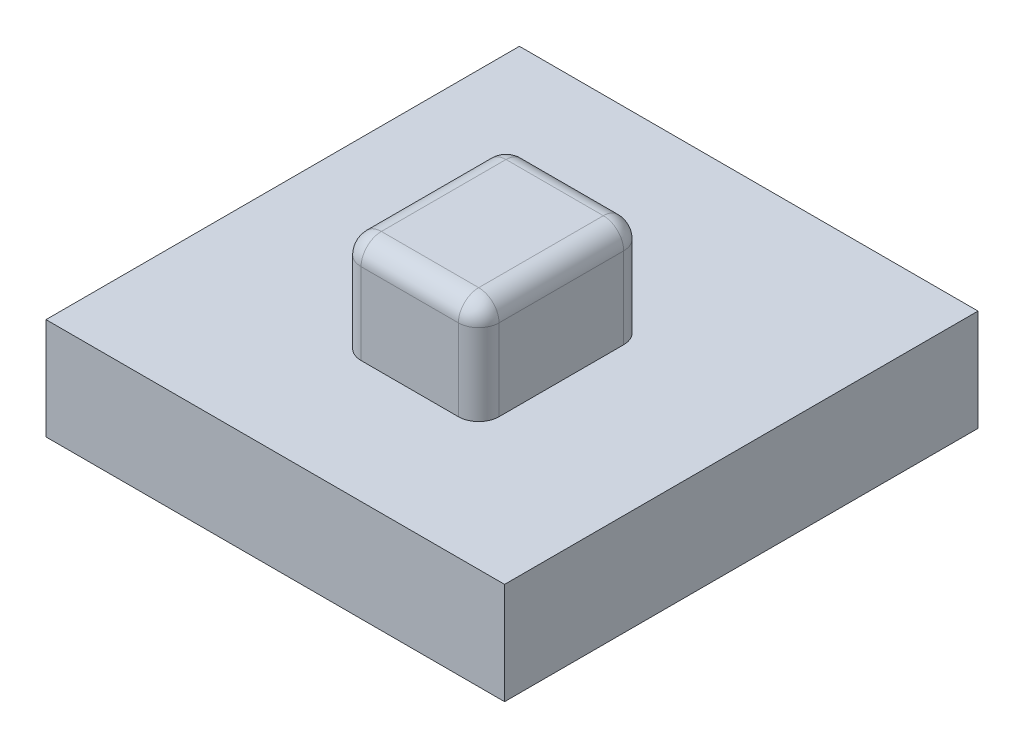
ISO-10303-21;
HEADER;
FILE_DESCRIPTION(('STEP AP214'),'2;1');
FILE_NAME('part.step','',(''),(''),'','','');
FILE_SCHEMA(('AUTOMOTIVE_DESIGN { 1 0 10303 214 1 1 1 1 }'));
ENDSEC;
DATA;
#1=APPLICATION_CONTEXT('core data for automotive mechanical design processes');
#2=APPLICATION_PROTOCOL_DEFINITION('international standard','automotive_design',2000,#1);
#3=PRODUCT_CONTEXT('',#1,'mechanical');
#4=PRODUCT('Part','Part','',(#3));
#5=PRODUCT_RELATED_PRODUCT_CATEGORY('part','',(#4));
#6=PRODUCT_DEFINITION_FORMATION('','',#4);
#7=PRODUCT_DEFINITION_CONTEXT('part definition',#1,'design');
#8=PRODUCT_DEFINITION('design','',#6,#7);
#9=PRODUCT_DEFINITION_SHAPE('','',#8);
#10=(LENGTH_UNIT() NAMED_UNIT(*) SI_UNIT(.MILLI.,.METRE.));
#11=(NAMED_UNIT(*) PLANE_ANGLE_UNIT() SI_UNIT($,.RADIAN.));
#12=(NAMED_UNIT(*) SI_UNIT($,.STERADIAN.) SOLID_ANGLE_UNIT());
#13=UNCERTAINTY_MEASURE_WITH_UNIT(LENGTH_MEASURE(1.E-05),#10,'distance_accuracy_value','');
#14=(GEOMETRIC_REPRESENTATION_CONTEXT(3) GLOBAL_UNCERTAINTY_ASSIGNED_CONTEXT((#13)) GLOBAL_UNIT_ASSIGNED_CONTEXT((#10,
#11,#12)) REPRESENTATION_CONTEXT('',''));
#15=CARTESIAN_POINT('',(0.,0.,0.));
#16=DIRECTION('',(0.,0.,1.));
#17=DIRECTION('',(1.,0.,0.));
#18=AXIS2_PLACEMENT_3D('',#15,#16,#17);
#19=CARTESIAN_POINT('',(-64.2406784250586,10.,15.1001488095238));
#20=DIRECTION('',(0.,1.,0.));
#21=DIRECTION('',(0.,0.,1.));
#22=AXIS2_PLACEMENT_3D('',#19,#20,#21);
#23=PLANE('',#22);
#24=DIRECTION('',(0.,0.,1.));
#25=VECTOR('',#24,1.);
#26=CARTESIAN_POINT('',(-64.2406784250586,10.,-31.4854166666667));
#27=LINE('',#26,#25);
#28=CARTESIAN_POINT('',(-64.2406784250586,10.,-31.4854166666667));
#29=VERTEX_POINT('',#28);
#30=CARTESIAN_POINT('',(-64.2406784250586,10.,15.1001488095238));
#31=VERTEX_POINT('',#30);
#32=EDGE_CURVE('E145',#29,#31,#27,.T.);
#33=ORIENTED_EDGE('',*,*,#32,.T.);
#34=DIRECTION('',(1.,0.,0.));
#35=VECTOR('',#34,1.);
#36=CARTESIAN_POINT('',(-64.2406784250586,10.,15.1001488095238));
#37=LINE('',#36,#35);
#38=CARTESIAN_POINT('',(-19.1143930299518,10.,15.1001488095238));
#39=VERTEX_POINT('',#38);
#40=EDGE_CURVE('E134',#31,#39,#37,.T.);
#41=ORIENTED_EDGE('',*,*,#40,.T.);
#42=DIRECTION('',(0.,0.,-1.));
#43=VECTOR('',#42,1.);
#44=CARTESIAN_POINT('',(-19.1143930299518,10.,-31.4854166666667));
#45=LINE('',#44,#43);
#46=CARTESIAN_POINT('',(-19.1143930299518,10.,-31.4854166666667));
#47=VERTEX_POINT('',#46);
#48=EDGE_CURVE('E144',#39,#47,#45,.T.);
#49=ORIENTED_EDGE('',*,*,#48,.T.);
#50=DIRECTION('',(-1.,0.,0.));
#51=VECTOR('',#50,1.);
#52=CARTESIAN_POINT('',(-64.2406784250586,10.,-31.4854166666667));
#53=LINE('',#52,#51);
#54=EDGE_CURVE('E150',#47,#29,#53,.T.);
#55=ORIENTED_EDGE('',*,*,#54,.T.);
#56=EDGE_LOOP('',(#33,#41,#49,#55));
#57=FACE_BOUND('',#56,.T.);
#58=DIRECTION('',(1.,0.,0.));
#59=VECTOR('',#58,1.);
#60=CARTESIAN_POINT('',(-47.2518598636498,10.,3.08627535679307));
#61=LINE('',#60,#59);
#62=CARTESIAN_POINT('',(-45.2518598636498,10.,3.08627535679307));
#63=VERTEX_POINT('',#62);
#64=CARTESIAN_POINT('',(-35.6738867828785,10.,3.08627535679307));
#65=VERTEX_POINT('',#64);
#66=EDGE_CURVE('E237',#63,#65,#61,.T.);
#67=ORIENTED_EDGE('',*,*,#66,.F.);
#68=CARTESIAN_POINT('',(-45.2518598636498,10.,1.08627535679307));
#69=DIRECTION('',(0.,1.,0.));
#70=DIRECTION('',(0.,0.,1.));
#71=AXIS2_PLACEMENT_3D('',#68,#69,#70);
#72=CIRCLE('',#71,2.);
#73=CARTESIAN_POINT('',(-47.2518598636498,10.,1.08627535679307));
#74=VERTEX_POINT('',#73);
#75=EDGE_CURVE('E11',#63,#74,#72,.F.);
#76=ORIENTED_EDGE('',*,*,#75,.T.);
#77=DIRECTION('',(0.,0.,1.));
#78=VECTOR('',#77,1.);
#79=CARTESIAN_POINT('',(-47.2518598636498,10.,-13.1784948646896));
#80=LINE('',#79,#78);
#81=CARTESIAN_POINT('',(-47.2518598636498,10.,-11.1784948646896));
#82=VERTEX_POINT('',#81);
#83=EDGE_CURVE('E234',#82,#74,#80,.T.);
#84=ORIENTED_EDGE('',*,*,#83,.F.);
#85=CARTESIAN_POINT('',(-45.2518598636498,10.,-11.1784948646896));
#86=DIRECTION('',(0.,1.,0.));
#87=DIRECTION('',(0.,0.,1.));
#88=AXIS2_PLACEMENT_3D('',#85,#86,#87);
#89=CIRCLE('',#88,2.);
#90=CARTESIAN_POINT('',(-45.2518598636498,10.,-13.1784948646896));
#91=VERTEX_POINT('',#90);
#92=EDGE_CURVE('E196',#82,#91,#89,.F.);
#93=ORIENTED_EDGE('',*,*,#92,.T.);
#94=DIRECTION('',(-1.,0.,0.));
#95=VECTOR('',#94,1.);
#96=CARTESIAN_POINT('',(-47.2518598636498,10.,-13.1784948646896));
#97=LINE('',#96,#95);
#98=CARTESIAN_POINT('',(-35.6738867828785,10.,-13.1784948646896));
#99=VERTEX_POINT('',#98);
#100=EDGE_CURVE('E247',#99,#91,#97,.T.);
#101=ORIENTED_EDGE('',*,*,#100,.F.);
#102=CARTESIAN_POINT('',(-35.6738867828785,10.,-11.1784948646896));
#103=DIRECTION('',(0.,1.,0.));
#104=DIRECTION('',(0.,0.,1.));
#105=AXIS2_PLACEMENT_3D('',#102,#103,#104);
#106=CIRCLE('',#105,2.);
#107=CARTESIAN_POINT('',(-33.6738867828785,10.,-11.1784948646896));
#108=VERTEX_POINT('',#107);
#109=EDGE_CURVE('E198',#99,#108,#106,.F.);
#110=ORIENTED_EDGE('',*,*,#109,.T.);
#111=DIRECTION('',(0.,0.,-1.));
#112=VECTOR('',#111,1.);
#113=CARTESIAN_POINT('',(-33.6738867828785,10.,-13.1784948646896));
#114=LINE('',#113,#112);
#115=CARTESIAN_POINT('',(-33.6738867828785,10.,1.08627535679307));
#116=VERTEX_POINT('',#115);
#117=EDGE_CURVE('E242',#116,#108,#114,.T.);
#118=ORIENTED_EDGE('',*,*,#117,.F.);
#119=CARTESIAN_POINT('',(-35.6738867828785,10.,1.08627535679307));
#120=DIRECTION('',(0.,1.,0.));
#121=DIRECTION('',(0.,0.,1.));
#122=AXIS2_PLACEMENT_3D('',#119,#120,#121);
#123=CIRCLE('',#122,2.);
#124=EDGE_CURVE('E41',#116,#65,#123,.F.);
#125=ORIENTED_EDGE('',*,*,#124,.T.);
#126=EDGE_LOOP('',(#67,#76,#84,#93,#101,#110,#118,#125));
#127=FACE_BOUND('',#126,.T.);
#128=ADVANCED_FACE('F32',(#57,#127),#23,.T.);
#129=CARTESIAN_POINT('',(-64.2406784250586,10.,-31.4854166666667));
#130=DIRECTION('',(1.,0.,0.));
#131=DIRECTION('',(0.,0.,-1.));
#132=AXIS2_PLACEMENT_3D('',#129,#130,#131);
#133=PLANE('',#132);
#134=DIRECTION('',(0.,0.,1.));
#135=VECTOR('',#134,1.);
#136=CARTESIAN_POINT('',(-64.2406784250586,0.,-31.4854166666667));
#137=LINE('',#136,#135);
#138=CARTESIAN_POINT('',(-64.2406784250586,0.,-31.4854166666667));
#139=VERTEX_POINT('',#138);
#140=CARTESIAN_POINT('',(-64.2406784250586,0.,15.1001488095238));
#141=VERTEX_POINT('',#140);
#142=EDGE_CURVE('E158',#139,#141,#137,.T.);
#143=ORIENTED_EDGE('',*,*,#142,.T.);
#144=DIRECTION('',(0.,-1.,0.));
#145=VECTOR('',#144,1.);
#146=CARTESIAN_POINT('',(-64.2406784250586,10.,15.1001488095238));
#147=LINE('',#146,#145);
#148=EDGE_CURVE('E138',#31,#141,#147,.T.);
#149=ORIENTED_EDGE('',*,*,#148,.F.);
#150=ORIENTED_EDGE('',*,*,#32,.F.);
#151=DIRECTION('',(0.,-1.,0.));
#152=VECTOR('',#151,1.);
#153=CARTESIAN_POINT('',(-64.2406784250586,10.,-31.4854166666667));
#154=LINE('',#153,#152);
#155=EDGE_CURVE('E252',#29,#139,#154,.T.);
#156=ORIENTED_EDGE('',*,*,#155,.T.);
#157=EDGE_LOOP('',(#143,#149,#150,#156));
#158=FACE_BOUND('',#157,.T.);
#159=ADVANCED_FACE('F156',(#158),#133,.F.);
#160=CARTESIAN_POINT('',(-64.2406784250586,10.,15.1001488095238));
#161=DIRECTION('',(0.,0.,-1.));
#162=DIRECTION('',(-1.,0.,0.));
#163=AXIS2_PLACEMENT_3D('',#160,#161,#162);
#164=PLANE('',#163);
#165=DIRECTION('',(1.,0.,0.));
#166=VECTOR('',#165,1.);
#167=CARTESIAN_POINT('',(-64.2406784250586,0.,15.1001488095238));
#168=LINE('',#167,#166);
#169=CARTESIAN_POINT('',(-19.1143930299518,0.,15.1001488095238));
#170=VERTEX_POINT('',#169);
#171=EDGE_CURVE('E254',#141,#170,#168,.T.);
#172=ORIENTED_EDGE('',*,*,#171,.T.);
#173=DIRECTION('',(0.,-1.,0.));
#174=VECTOR('',#173,1.);
#175=CARTESIAN_POINT('',(-19.1143930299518,10.,15.1001488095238));
#176=LINE('',#175,#174);
#177=EDGE_CURVE('E141',#39,#170,#176,.T.);
#178=ORIENTED_EDGE('',*,*,#177,.F.);
#179=ORIENTED_EDGE('',*,*,#40,.F.);
#180=ORIENTED_EDGE('',*,*,#148,.T.);
#181=EDGE_LOOP('',(#172,#178,#179,#180));
#182=FACE_BOUND('',#181,.T.);
#183=ADVANCED_FACE('F136',(#182),#164,.F.);
#184=CARTESIAN_POINT('',(-19.1143930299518,10.,-31.4854166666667));
#185=DIRECTION('',(-1.,0.,0.));
#186=DIRECTION('',(0.,0.,1.));
#187=AXIS2_PLACEMENT_3D('',#184,#185,#186);
#188=PLANE('',#187);
#189=DIRECTION('',(0.,0.,-1.));
#190=VECTOR('',#189,1.);
#191=CARTESIAN_POINT('',(-19.1143930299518,0.,-31.4854166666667));
#192=LINE('',#191,#190);
#193=CARTESIAN_POINT('',(-19.1143930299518,0.,-31.4854166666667));
#194=VERTEX_POINT('',#193);
#195=EDGE_CURVE('E256',#170,#194,#192,.T.);
#196=ORIENTED_EDGE('',*,*,#195,.T.);
#197=DIRECTION('',(0.,-1.,0.));
#198=VECTOR('',#197,1.);
#199=CARTESIAN_POINT('',(-19.1143930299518,10.,-31.4854166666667));
#200=LINE('',#199,#198);
#201=EDGE_CURVE('E163',#47,#194,#200,.T.);
#202=ORIENTED_EDGE('',*,*,#201,.F.);
#203=ORIENTED_EDGE('',*,*,#48,.F.);
#204=ORIENTED_EDGE('',*,*,#177,.T.);
#205=EDGE_LOOP('',(#196,#202,#203,#204));
#206=FACE_BOUND('',#205,.T.);
#207=ADVANCED_FACE('F268',(#206),#188,.F.);
#208=CARTESIAN_POINT('',(-64.2406784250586,10.,-31.4854166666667));
#209=DIRECTION('',(0.,0.,1.));
#210=DIRECTION('',(1.,0.,0.));
#211=AXIS2_PLACEMENT_3D('',#208,#209,#210);
#212=PLANE('',#211);
#213=DIRECTION('',(-1.,0.,0.));
#214=VECTOR('',#213,1.);
#215=CARTESIAN_POINT('',(-64.2406784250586,0.,-31.4854166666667));
#216=LINE('',#215,#214);
#217=EDGE_CURVE('E154',#194,#139,#216,.T.);
#218=ORIENTED_EDGE('',*,*,#217,.T.);
#219=ORIENTED_EDGE('',*,*,#155,.F.);
#220=ORIENTED_EDGE('',*,*,#54,.F.);
#221=ORIENTED_EDGE('',*,*,#201,.T.);
#222=EDGE_LOOP('',(#218,#219,#220,#221));
#223=FACE_BOUND('',#222,.T.);
#224=ADVANCED_FACE('F263',(#223),#212,.F.);
#225=CARTESIAN_POINT('',(-64.2406784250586,0.,15.1001488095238));
#226=DIRECTION('',(0.,1.,0.));
#227=DIRECTION('',(0.,0.,1.));
#228=AXIS2_PLACEMENT_3D('',#225,#226,#227);
#229=PLANE('',#228);
#230=ORIENTED_EDGE('',*,*,#142,.F.);
#231=ORIENTED_EDGE('',*,*,#217,.F.);
#232=ORIENTED_EDGE('',*,*,#195,.F.);
#233=ORIENTED_EDGE('',*,*,#171,.F.);
#234=EDGE_LOOP('',(#230,#231,#232,#233));
#235=FACE_BOUND('',#234,.T.);
#236=ADVANCED_FACE('F267',(#235),#229,.F.);
#237=CARTESIAN_POINT('',(-47.2518598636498,20.,-13.1784948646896));
#238=DIRECTION('',(1.,0.,0.));
#239=DIRECTION('',(0.,0.,-1.));
#240=AXIS2_PLACEMENT_3D('',#237,#238,#239);
#241=PLANE('',#240);
#242=DIRECTION('',(0.,0.,1.));
#243=VECTOR('',#242,1.);
#244=CARTESIAN_POINT('',(-47.2518598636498,18.,-13.1784948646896));
#245=LINE('',#244,#243);
#246=CARTESIAN_POINT('',(-47.2518598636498,18.,1.08627535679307));
#247=VERTEX_POINT('',#246);
#248=CARTESIAN_POINT('',(-47.2518598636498,18.,-11.1784948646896));
#249=VERTEX_POINT('',#248);
#250=EDGE_CURVE('E175',#247,#249,#245,.F.);
#251=ORIENTED_EDGE('',*,*,#250,.T.);
#252=DIRECTION('',(0.,-1.,0.));
#253=VECTOR('',#252,1.);
#254=CARTESIAN_POINT('',(-47.2518598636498,20.,-11.1784948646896));
#255=LINE('',#254,#253);
#256=EDGE_CURVE('E178',#249,#82,#255,.T.);
#257=ORIENTED_EDGE('',*,*,#256,.T.);
#258=ORIENTED_EDGE('',*,*,#83,.T.);
#259=DIRECTION('',(0.,-1.,0.));
#260=VECTOR('',#259,1.);
#261=CARTESIAN_POINT('',(-47.2518598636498,20.,1.08627535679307));
#262=LINE('',#261,#260);
#263=EDGE_CURVE('E173',#74,#247,#262,.F.);
#264=ORIENTED_EDGE('',*,*,#263,.T.);
#265=EDGE_LOOP('',(#251,#257,#258,#264));
#266=FACE_BOUND('',#265,.T.);
#267=ADVANCED_FACE('F285',(#266),#241,.F.);
#268=CARTESIAN_POINT('',(-47.2518598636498,20.,3.08627535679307));
#269=DIRECTION('',(0.,0.,-1.));
#270=DIRECTION('',(-1.,0.,0.));
#271=AXIS2_PLACEMENT_3D('',#268,#269,#270);
#272=PLANE('',#271);
#273=ORIENTED_EDGE('',*,*,#66,.T.);
#274=DIRECTION('',(0.,-1.,0.));
#275=VECTOR('',#274,1.);
#276=CARTESIAN_POINT('',(-35.6738867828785,20.,3.08627535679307));
#277=LINE('',#276,#275);
#278=CARTESIAN_POINT('',(-35.6738867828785,18.,3.08627535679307));
#279=VERTEX_POINT('',#278);
#280=EDGE_CURVE('E54',#65,#279,#277,.F.);
#281=ORIENTED_EDGE('',*,*,#280,.T.);
#282=DIRECTION('',(1.,0.,0.));
#283=VECTOR('',#282,1.);
#284=CARTESIAN_POINT('',(-47.2518598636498,18.,3.08627535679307));
#285=LINE('',#284,#283);
#286=CARTESIAN_POINT('',(-45.2518598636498,18.,3.08627535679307));
#287=VERTEX_POINT('',#286);
#288=EDGE_CURVE('E49',#279,#287,#285,.F.);
#289=ORIENTED_EDGE('',*,*,#288,.T.);
#290=DIRECTION('',(0.,-1.,0.));
#291=VECTOR('',#290,1.);
#292=CARTESIAN_POINT('',(-45.2518598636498,20.,3.08627535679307));
#293=LINE('',#292,#291);
#294=EDGE_CURVE('E193',#287,#63,#293,.T.);
#295=ORIENTED_EDGE('',*,*,#294,.T.);
#296=EDGE_LOOP('',(#273,#281,#289,#295));
#297=FACE_BOUND('',#296,.T.);
#298=ADVANCED_FACE('F291',(#297),#272,.F.);
#299=CARTESIAN_POINT('',(-33.6738867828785,20.,-13.1784948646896));
#300=DIRECTION('',(-1.,0.,0.));
#301=DIRECTION('',(0.,0.,1.));
#302=AXIS2_PLACEMENT_3D('',#299,#300,#301);
#303=PLANE('',#302);
#304=ORIENTED_EDGE('',*,*,#117,.T.);
#305=DIRECTION('',(0.,-1.,0.));
#306=VECTOR('',#305,1.);
#307=CARTESIAN_POINT('',(-33.6738867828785,20.,-11.1784948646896));
#308=LINE('',#307,#306);
#309=CARTESIAN_POINT('',(-33.6738867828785,18.,-11.1784948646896));
#310=VERTEX_POINT('',#309);
#311=EDGE_CURVE('E184',#108,#310,#308,.F.);
#312=ORIENTED_EDGE('',*,*,#311,.T.);
#313=DIRECTION('',(0.,0.,-1.));
#314=VECTOR('',#313,1.);
#315=CARTESIAN_POINT('',(-33.6738867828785,18.,3.08627535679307));
#316=LINE('',#315,#314);
#317=CARTESIAN_POINT('',(-33.6738867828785,18.,1.08627535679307));
#318=VERTEX_POINT('',#317);
#319=EDGE_CURVE('E182',#310,#318,#316,.F.);
#320=ORIENTED_EDGE('',*,*,#319,.T.);
#321=DIRECTION('',(0.,-1.,0.));
#322=VECTOR('',#321,1.);
#323=CARTESIAN_POINT('',(-33.6738867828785,20.,1.08627535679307));
#324=LINE('',#323,#322);
#325=EDGE_CURVE('E180',#318,#116,#324,.T.);
#326=ORIENTED_EDGE('',*,*,#325,.T.);
#327=EDGE_LOOP('',(#304,#312,#320,#326));
#328=FACE_BOUND('',#327,.T.);
#329=ADVANCED_FACE('F295',(#328),#303,.F.);
#330=CARTESIAN_POINT('',(-47.2518598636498,20.,-13.1784948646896));
#331=DIRECTION('',(0.,0.,1.));
#332=DIRECTION('',(1.,0.,0.));
#333=AXIS2_PLACEMENT_3D('',#330,#331,#332);
#334=PLANE('',#333);
#335=ORIENTED_EDGE('',*,*,#100,.T.);
#336=DIRECTION('',(0.,-1.,0.));
#337=VECTOR('',#336,1.);
#338=CARTESIAN_POINT('',(-45.2518598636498,20.,-13.1784948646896));
#339=LINE('',#338,#337);
#340=CARTESIAN_POINT('',(-45.2518598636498,18.,-13.1784948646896));
#341=VERTEX_POINT('',#340);
#342=EDGE_CURVE('E190',#91,#341,#339,.F.);
#343=ORIENTED_EDGE('',*,*,#342,.T.);
#344=DIRECTION('',(-1.,0.,0.));
#345=VECTOR('',#344,1.);
#346=CARTESIAN_POINT('',(-33.6738867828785,18.,-13.1784948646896));
#347=LINE('',#346,#345);
#348=CARTESIAN_POINT('',(-35.6738867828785,18.,-13.1784948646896));
#349=VERTEX_POINT('',#348);
#350=EDGE_CURVE('E188',#341,#349,#347,.F.);
#351=ORIENTED_EDGE('',*,*,#350,.T.);
#352=DIRECTION('',(0.,-1.,0.));
#353=VECTOR('',#352,1.);
#354=CARTESIAN_POINT('',(-35.6738867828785,20.,-13.1784948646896));
#355=LINE('',#354,#353);
#356=EDGE_CURVE('E186',#349,#99,#355,.T.);
#357=ORIENTED_EDGE('',*,*,#356,.T.);
#358=EDGE_LOOP('',(#335,#343,#351,#357));
#359=FACE_BOUND('',#358,.T.);
#360=ADVANCED_FACE('F330',(#359),#334,.F.);
#361=CARTESIAN_POINT('',(-47.2518598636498,20.,3.08627535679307));
#362=DIRECTION('',(0.,1.,0.));
#363=DIRECTION('',(0.,0.,1.));
#364=AXIS2_PLACEMENT_3D('',#361,#362,#363);
#365=PLANE('',#364);
#366=DIRECTION('',(0.,0.,-1.));
#367=VECTOR('',#366,1.);
#368=CARTESIAN_POINT('',(-35.6738867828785,20.,-13.1784948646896));
#369=LINE('',#368,#367);
#370=CARTESIAN_POINT('',(-35.6738867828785,20.,1.08627535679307));
#371=VERTEX_POINT('',#370);
#372=CARTESIAN_POINT('',(-35.6738867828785,20.,-11.1784948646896));
#373=VERTEX_POINT('',#372);
#374=EDGE_CURVE('E161',#371,#373,#369,.T.);
#375=ORIENTED_EDGE('',*,*,#374,.T.);
#376=DIRECTION('',(-1.,0.,0.));
#377=VECTOR('',#376,1.);
#378=CARTESIAN_POINT('',(-47.2518598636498,20.,-11.1784948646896));
#379=LINE('',#378,#377);
#380=CARTESIAN_POINT('',(-45.2518598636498,20.,-11.1784948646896));
#381=VERTEX_POINT('',#380);
#382=EDGE_CURVE('E171',#373,#381,#379,.T.);
#383=ORIENTED_EDGE('',*,*,#382,.T.);
#384=DIRECTION('',(0.,0.,1.));
#385=VECTOR('',#384,1.);
#386=CARTESIAN_POINT('',(-45.2518598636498,20.,3.08627535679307));
#387=LINE('',#386,#385);
#388=CARTESIAN_POINT('',(-45.2518598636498,20.,1.08627535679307));
#389=VERTEX_POINT('',#388);
#390=EDGE_CURVE('E168',#381,#389,#387,.T.);
#391=ORIENTED_EDGE('',*,*,#390,.T.);
#392=DIRECTION('',(1.,0.,0.));
#393=VECTOR('',#392,1.);
#394=CARTESIAN_POINT('',(-33.6738867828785,20.,1.08627535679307));
#395=LINE('',#394,#393);
#396=EDGE_CURVE('E159',#389,#371,#395,.T.);
#397=ORIENTED_EDGE('',*,*,#396,.T.);
#398=EDGE_LOOP('',(#375,#383,#391,#397));
#399=FACE_BOUND('',#398,.T.);
#400=ADVANCED_FACE('F313',(#399),#365,.T.);
#401=CARTESIAN_POINT('',(-35.6738867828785,20.,-11.1784948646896));
#402=DIRECTION('',(0.,-1.,0.));
#403=DIRECTION('',(0.,0.,-1.));
#404=AXIS2_PLACEMENT_3D('',#401,#402,#403);
#405=CYLINDRICAL_SURFACE('',#404,2.);
#406=ORIENTED_EDGE('',*,*,#109,.F.);
#407=ORIENTED_EDGE('',*,*,#356,.F.);
#408=CARTESIAN_POINT('',(-35.6738867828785,18.,-11.1784948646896));
#409=DIRECTION('',(0.,1.,0.));
#410=DIRECTION('',(0.,0.,1.));
#411=AXIS2_PLACEMENT_3D('',#408,#409,#410);
#412=CIRCLE('',#411,2.);
#413=EDGE_CURVE('E36',#310,#349,#412,.T.);
#414=ORIENTED_EDGE('',*,*,#413,.F.);
#415=ORIENTED_EDGE('',*,*,#311,.F.);
#416=EDGE_LOOP('',(#406,#407,#414,#415));
#417=FACE_BOUND('',#416,.T.);
#418=ADVANCED_FACE('F34',(#417),#405,.T.);
#419=CARTESIAN_POINT('',(-35.6738867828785,18.,3.08627535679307));
#420=DIRECTION('',(0.,0.,1.));
#421=DIRECTION('',(1.,0.,0.));
#422=AXIS2_PLACEMENT_3D('',#419,#420,#421);
#423=CYLINDRICAL_SURFACE('',#422,2.);
#424=CARTESIAN_POINT('',(-35.6738867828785,18.,1.08627535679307));
#425=DIRECTION('',(0.,0.,1.));
#426=DIRECTION('',(1.,0.,0.));
#427=AXIS2_PLACEMENT_3D('',#424,#425,#426);
#428=CIRCLE('',#427,2.);
#429=EDGE_CURVE('E226',#318,#371,#428,.T.);
#430=ORIENTED_EDGE('',*,*,#429,.F.);
#431=ORIENTED_EDGE('',*,*,#319,.F.);
#432=CARTESIAN_POINT('',(-35.6738867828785,18.,-11.1784948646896));
#433=DIRECTION('',(0.,0.,-1.));
#434=DIRECTION('',(-1.,0.,0.));
#435=AXIS2_PLACEMENT_3D('',#432,#433,#434);
#436=CIRCLE('',#435,2.);
#437=EDGE_CURVE('E228',#373,#310,#436,.T.);
#438=ORIENTED_EDGE('',*,*,#437,.F.);
#439=ORIENTED_EDGE('',*,*,#374,.F.);
#440=EDGE_LOOP('',(#430,#431,#438,#439));
#441=FACE_BOUND('',#440,.T.);
#442=ADVANCED_FACE('F343',(#441),#423,.T.);
#443=CARTESIAN_POINT('',(-35.6738867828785,20.,1.08627535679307));
#444=DIRECTION('',(0.,-1.,0.));
#445=DIRECTION('',(0.,0.,-1.));
#446=AXIS2_PLACEMENT_3D('',#443,#444,#445);
#447=CYLINDRICAL_SURFACE('',#446,2.);
#448=ORIENTED_EDGE('',*,*,#124,.F.);
#449=ORIENTED_EDGE('',*,*,#325,.F.);
#450=CARTESIAN_POINT('',(-35.6738867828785,18.,1.08627535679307));
#451=DIRECTION('',(0.,1.,0.));
#452=DIRECTION('',(0.,0.,1.));
#453=AXIS2_PLACEMENT_3D('',#450,#451,#452);
#454=CIRCLE('',#453,2.);
#455=EDGE_CURVE('E223',#279,#318,#454,.T.);
#456=ORIENTED_EDGE('',*,*,#455,.F.);
#457=ORIENTED_EDGE('',*,*,#280,.F.);
#458=EDGE_LOOP('',(#448,#449,#456,#457));
#459=FACE_BOUND('',#458,.T.);
#460=ADVANCED_FACE('F341',(#459),#447,.T.);
#461=CARTESIAN_POINT('',(-35.6738867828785,18.,-11.1784948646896));
#462=DIRECTION('',(0.,0.,1.));
#463=DIRECTION('',(1.,0.,0.));
#464=AXIS2_PLACEMENT_3D('',#461,#462,#463);
#465=SPHERICAL_SURFACE('',#464,2.);
#466=ORIENTED_EDGE('',*,*,#437,.T.);
#467=ORIENTED_EDGE('',*,*,#413,.T.);
#468=CARTESIAN_POINT('',(-35.6738867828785,18.,-11.1784948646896));
#469=DIRECTION('',(1.,0.,0.));
#470=DIRECTION('',(0.,0.,-1.));
#471=AXIS2_PLACEMENT_3D('',#468,#469,#470);
#472=CIRCLE('',#471,2.);
#473=EDGE_CURVE('E220',#373,#349,#472,.F.);
#474=ORIENTED_EDGE('',*,*,#473,.F.);
#475=EDGE_LOOP('',(#466,#467,#474));
#476=FACE_BOUND('',#475,.T.);
#477=ADVANCED_FACE('F347',(#476),#465,.T.);
#478=CARTESIAN_POINT('',(-35.6738867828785,18.,1.08627535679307));
#479=DIRECTION('',(0.,0.,1.));
#480=DIRECTION('',(1.,0.,0.));
#481=AXIS2_PLACEMENT_3D('',#478,#479,#480);
#482=SPHERICAL_SURFACE('',#481,2.);
#483=ORIENTED_EDGE('',*,*,#455,.T.);
#484=ORIENTED_EDGE('',*,*,#429,.T.);
#485=CARTESIAN_POINT('',(-35.6738867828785,18.,1.08627535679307));
#486=DIRECTION('',(1.,0.,0.));
#487=DIRECTION('',(0.,0.,-1.));
#488=AXIS2_PLACEMENT_3D('',#485,#486,#487);
#489=CIRCLE('',#488,2.);
#490=EDGE_CURVE('E217',#279,#371,#489,.F.);
#491=ORIENTED_EDGE('',*,*,#490,.F.);
#492=EDGE_LOOP('',(#483,#484,#491));
#493=FACE_BOUND('',#492,.T.);
#494=ADVANCED_FACE('F345',(#493),#482,.T.);
#495=CARTESIAN_POINT('',(-45.2518598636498,20.,-11.1784948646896));
#496=DIRECTION('',(0.,-1.,0.));
#497=DIRECTION('',(0.,0.,-1.));
#498=AXIS2_PLACEMENT_3D('',#495,#496,#497);
#499=CYLINDRICAL_SURFACE('',#498,2.);
#500=ORIENTED_EDGE('',*,*,#92,.F.);
#501=ORIENTED_EDGE('',*,*,#256,.F.);
#502=CARTESIAN_POINT('',(-45.2518598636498,18.,-11.1784948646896));
#503=DIRECTION('',(0.,1.,0.));
#504=DIRECTION('',(0.,0.,1.));
#505=AXIS2_PLACEMENT_3D('',#502,#503,#504);
#506=CIRCLE('',#505,2.);
#507=EDGE_CURVE('E214',#341,#249,#506,.T.);
#508=ORIENTED_EDGE('',*,*,#507,.F.);
#509=ORIENTED_EDGE('',*,*,#342,.F.);
#510=EDGE_LOOP('',(#500,#501,#508,#509));
#511=FACE_BOUND('',#510,.T.);
#512=ADVANCED_FACE('F325',(#511),#499,.T.);
#513=CARTESIAN_POINT('',(-47.2518598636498,18.,-11.1784948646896));
#514=DIRECTION('',(1.,0.,0.));
#515=DIRECTION('',(0.,0.,-1.));
#516=AXIS2_PLACEMENT_3D('',#513,#514,#515);
#517=CYLINDRICAL_SURFACE('',#516,2.);
#518=ORIENTED_EDGE('',*,*,#473,.T.);
#519=ORIENTED_EDGE('',*,*,#350,.F.);
#520=CARTESIAN_POINT('',(-45.2518598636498,18.,-11.1784948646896));
#521=DIRECTION('',(-1.,0.,0.));
#522=DIRECTION('',(0.,0.,1.));
#523=AXIS2_PLACEMENT_3D('',#520,#521,#522);
#524=CIRCLE('',#523,2.);
#525=EDGE_CURVE('E211',#381,#341,#524,.T.);
#526=ORIENTED_EDGE('',*,*,#525,.F.);
#527=ORIENTED_EDGE('',*,*,#382,.F.);
#528=EDGE_LOOP('',(#518,#519,#526,#527));
#529=FACE_BOUND('',#528,.T.);
#530=ADVANCED_FACE('F318',(#529),#517,.T.);
#531=CARTESIAN_POINT('',(-47.2518598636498,18.,1.08627535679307));
#532=DIRECTION('',(-1.,0.,0.));
#533=DIRECTION('',(0.,0.,1.));
#534=AXIS2_PLACEMENT_3D('',#531,#532,#533);
#535=CYLINDRICAL_SURFACE('',#534,2.);
#536=ORIENTED_EDGE('',*,*,#490,.T.);
#537=ORIENTED_EDGE('',*,*,#396,.F.);
#538=CARTESIAN_POINT('',(-45.2518598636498,18.,1.08627535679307));
#539=DIRECTION('',(-1.,0.,0.));
#540=DIRECTION('',(0.,0.,1.));
#541=AXIS2_PLACEMENT_3D('',#538,#539,#540);
#542=CIRCLE('',#541,2.);
#543=EDGE_CURVE('E208',#287,#389,#542,.T.);
#544=ORIENTED_EDGE('',*,*,#543,.F.);
#545=ORIENTED_EDGE('',*,*,#288,.F.);
#546=EDGE_LOOP('',(#536,#537,#544,#545));
#547=FACE_BOUND('',#546,.T.);
#548=ADVANCED_FACE('F309',(#547),#535,.T.);
#549=CARTESIAN_POINT('',(-45.2518598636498,20.,1.08627535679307));
#550=DIRECTION('',(0.,-1.,0.));
#551=DIRECTION('',(0.,0.,-1.));
#552=AXIS2_PLACEMENT_3D('',#549,#550,#551);
#553=CYLINDRICAL_SURFACE('',#552,2.);
#554=ORIENTED_EDGE('',*,*,#75,.F.);
#555=ORIENTED_EDGE('',*,*,#294,.F.);
#556=CARTESIAN_POINT('',(-45.2518598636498,18.,1.08627535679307));
#557=DIRECTION('',(0.,1.,0.));
#558=DIRECTION('',(0.,0.,1.));
#559=AXIS2_PLACEMENT_3D('',#556,#557,#558);
#560=CIRCLE('',#559,2.);
#561=EDGE_CURVE('E205',#247,#287,#560,.T.);
#562=ORIENTED_EDGE('',*,*,#561,.F.);
#563=ORIENTED_EDGE('',*,*,#263,.F.);
#564=EDGE_LOOP('',(#554,#555,#562,#563));
#565=FACE_BOUND('',#564,.T.);
#566=ADVANCED_FACE('F430',(#565),#553,.T.);
#567=CARTESIAN_POINT('',(-45.2518598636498,18.,-11.1784948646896));
#568=DIRECTION('',(0.,0.,1.));
#569=DIRECTION('',(1.,0.,0.));
#570=AXIS2_PLACEMENT_3D('',#567,#568,#569);
#571=SPHERICAL_SURFACE('',#570,2.);
#572=ORIENTED_EDGE('',*,*,#525,.T.);
#573=ORIENTED_EDGE('',*,*,#507,.T.);
#574=CARTESIAN_POINT('',(-45.2518598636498,18.,-11.1784948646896));
#575=DIRECTION('',(0.,0.,-1.));
#576=DIRECTION('',(-1.,0.,0.));
#577=AXIS2_PLACEMENT_3D('',#574,#575,#576);
#578=CIRCLE('',#577,2.);
#579=EDGE_CURVE('E203',#381,#249,#578,.F.);
#580=ORIENTED_EDGE('',*,*,#579,.F.);
#581=EDGE_LOOP('',(#572,#573,#580));
#582=FACE_BOUND('',#581,.T.);
#583=ADVANCED_FACE('F321',(#582),#571,.T.);
#584=CARTESIAN_POINT('',(-45.2518598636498,18.,1.08627535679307));
#585=DIRECTION('',(0.,0.,1.));
#586=DIRECTION('',(1.,0.,0.));
#587=AXIS2_PLACEMENT_3D('',#584,#585,#586);
#588=SPHERICAL_SURFACE('',#587,2.);
#589=ORIENTED_EDGE('',*,*,#561,.T.);
#590=ORIENTED_EDGE('',*,*,#543,.T.);
#591=CARTESIAN_POINT('',(-45.2518598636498,18.,1.08627535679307));
#592=DIRECTION('',(0.,0.,1.));
#593=DIRECTION('',(1.,0.,0.));
#594=AXIS2_PLACEMENT_3D('',#591,#592,#593);
#595=CIRCLE('',#594,2.);
#596=EDGE_CURVE('E201',#247,#389,#595,.F.);
#597=ORIENTED_EDGE('',*,*,#596,.F.);
#598=EDGE_LOOP('',(#589,#590,#597));
#599=FACE_BOUND('',#598,.T.);
#600=ADVANCED_FACE('F305',(#599),#588,.T.);
#601=CARTESIAN_POINT('',(-45.2518598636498,18.,3.08627535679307));
#602=DIRECTION('',(0.,0.,-1.));
#603=DIRECTION('',(-1.,0.,0.));
#604=AXIS2_PLACEMENT_3D('',#601,#602,#603);
#605=CYLINDRICAL_SURFACE('',#604,2.);
#606=ORIENTED_EDGE('',*,*,#579,.T.);
#607=ORIENTED_EDGE('',*,*,#250,.F.);
#608=ORIENTED_EDGE('',*,*,#596,.T.);
#609=ORIENTED_EDGE('',*,*,#390,.F.);
#610=EDGE_LOOP('',(#606,#607,#608,#609));
#611=FACE_BOUND('',#610,.T.);
#612=ADVANCED_FACE('F301',(#611),#605,.T.);
#613=CLOSED_SHELL('',(#128,#159,#183,#207,#224,#236,#267,#298,#329,#360,#400,#418,#442,#460,
#477,#494,#512,#530,#548,#566,#583,#600,#612));
#614=MANIFOLD_SOLID_BREP('B2',#613);
#615=ADVANCED_BREP_SHAPE_REPRESENTATION('',(#18,#614),#14);
#616=SHAPE_DEFINITION_REPRESENTATION(#9,#615);
ENDSEC;
END-ISO-10303-21;
